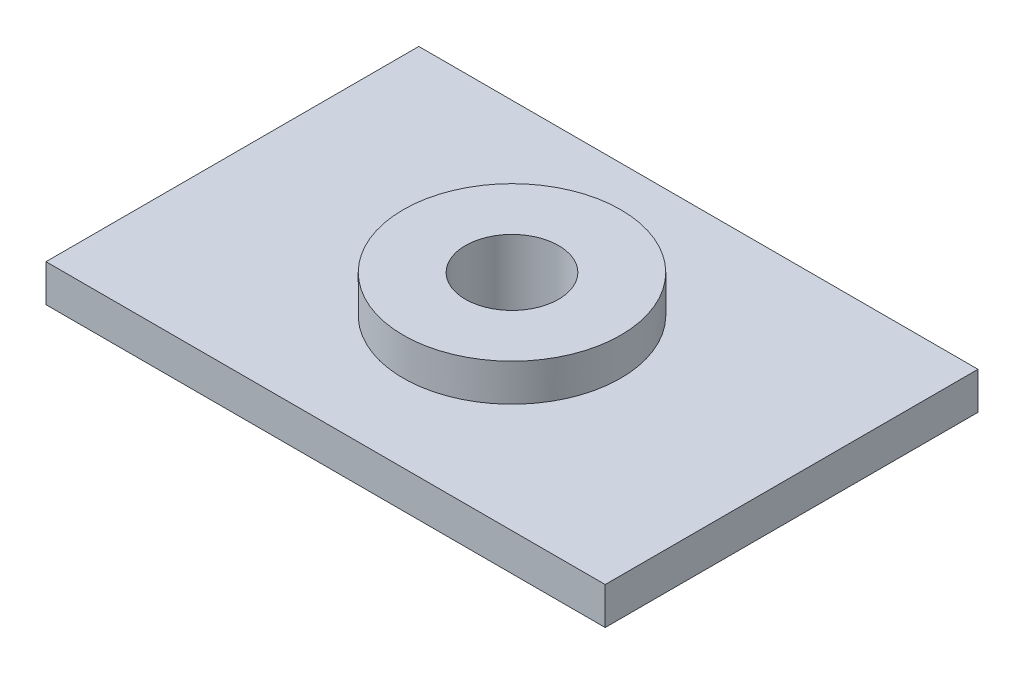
ISO-10303-21;
HEADER;
FILE_DESCRIPTION(('STEP AP214'),'2;1');
FILE_NAME('part.step','',(''),(''),'','','');
FILE_SCHEMA(('AUTOMOTIVE_DESIGN { 1 0 10303 214 1 1 1 1 }'));
ENDSEC;
DATA;
#1=APPLICATION_CONTEXT('core data for automotive mechanical design processes');
#2=APPLICATION_PROTOCOL_DEFINITION('international standard','automotive_design',2000,#1);
#3=PRODUCT_CONTEXT('',#1,'mechanical');
#4=PRODUCT('Part','Part','',(#3));
#5=PRODUCT_RELATED_PRODUCT_CATEGORY('part','',(#4));
#6=PRODUCT_DEFINITION_FORMATION('','',#4);
#7=PRODUCT_DEFINITION_CONTEXT('part definition',#1,'design');
#8=PRODUCT_DEFINITION('design','',#6,#7);
#9=PRODUCT_DEFINITION_SHAPE('','',#8);
#10=(LENGTH_UNIT() NAMED_UNIT(*) SI_UNIT(.MILLI.,.METRE.));
#11=(NAMED_UNIT(*) PLANE_ANGLE_UNIT() SI_UNIT($,.RADIAN.));
#12=(NAMED_UNIT(*) SI_UNIT($,.STERADIAN.) SOLID_ANGLE_UNIT());
#13=UNCERTAINTY_MEASURE_WITH_UNIT(LENGTH_MEASURE(1.E-05),#10,'distance_accuracy_value','');
#14=(GEOMETRIC_REPRESENTATION_CONTEXT(3) GLOBAL_UNCERTAINTY_ASSIGNED_CONTEXT((#13)) GLOBAL_UNIT_ASSIGNED_CONTEXT((#10,
#11,#12)) REPRESENTATION_CONTEXT('',''));
#15=CARTESIAN_POINT('',(0.,0.,0.));
#16=DIRECTION('',(0.,0.,1.));
#17=DIRECTION('',(1.,0.,0.));
#18=AXIS2_PLACEMENT_3D('',#15,#16,#17);
#19=CARTESIAN_POINT('',(0.,12.,-120.));
#20=DIRECTION('',(0.,-1.,0.));
#21=DIRECTION('',(0.,0.,-1.));
#22=AXIS2_PLACEMENT_3D('',#19,#20,#21);
#23=PLANE('',#22);
#24=DIRECTION('',(0.,0.,1.));
#25=VECTOR('',#24,1.);
#26=CARTESIAN_POINT('',(0.,12.,0.));
#27=LINE('',#26,#25);
#28=CARTESIAN_POINT('',(0.,12.,-120.));
#29=VERTEX_POINT('',#28);
#30=CARTESIAN_POINT('',(0.,12.,0.));
#31=VERTEX_POINT('',#30);
#32=EDGE_CURVE('E96',#29,#31,#27,.T.);
#33=ORIENTED_EDGE('',*,*,#32,.T.);
#34=DIRECTION('',(1.,0.,0.));
#35=VECTOR('',#34,1.);
#36=CARTESIAN_POINT('',(0.,12.,0.));
#37=LINE('',#36,#35);
#38=CARTESIAN_POINT('',(180.,12.,0.));
#39=VERTEX_POINT('',#38);
#40=EDGE_CURVE('E80',#31,#39,#37,.T.);
#41=ORIENTED_EDGE('',*,*,#40,.T.);
#42=DIRECTION('',(0.,0.,-1.));
#43=VECTOR('',#42,1.);
#44=CARTESIAN_POINT('',(180.,12.,0.));
#45=LINE('',#44,#43);
#46=CARTESIAN_POINT('',(180.,12.,-120.));
#47=VERTEX_POINT('',#46);
#48=EDGE_CURVE('E46',#39,#47,#45,.T.);
#49=ORIENTED_EDGE('',*,*,#48,.T.);
#50=DIRECTION('',(-1.,0.,0.));
#51=VECTOR('',#50,1.);
#52=CARTESIAN_POINT('',(0.,12.,-120.));
#53=LINE('',#52,#51);
#54=EDGE_CURVE('E41',#47,#29,#53,.T.);
#55=ORIENTED_EDGE('',*,*,#54,.T.);
#56=EDGE_LOOP('',(#33,#41,#49,#55));
#57=FACE_BOUND('',#56,.T.);
#58=CARTESIAN_POINT('',(90.,12.,-60.));
#59=DIRECTION('',(0.,-1.,0.));
#60=DIRECTION('',(0.,0.,-1.));
#61=AXIS2_PLACEMENT_3D('',#58,#59,#60);
#62=CIRCLE('',#61,35.);
#63=CARTESIAN_POINT('',(90.,12.,-95.));
#64=VERTEX_POINT('',#63);
#65=EDGE_CURVE('E11',#64,#64,#62,.F.);
#66=ORIENTED_EDGE('',*,*,#65,.F.);
#67=EDGE_LOOP('',(#66));
#68=FACE_BOUND('',#67,.T.);
#69=ADVANCED_FACE('F26',(#57,#68),#23,.F.);
#70=CARTESIAN_POINT('',(0.,12.,0.));
#71=DIRECTION('',(1.,0.,0.));
#72=DIRECTION('',(0.,0.,-1.));
#73=AXIS2_PLACEMENT_3D('',#70,#71,#72);
#74=PLANE('',#73);
#75=DIRECTION('',(0.,0.,1.));
#76=VECTOR('',#75,1.);
#77=CARTESIAN_POINT('',(0.,0.,0.));
#78=LINE('',#77,#76);
#79=CARTESIAN_POINT('',(0.,0.,-120.));
#80=VERTEX_POINT('',#79);
#81=CARTESIAN_POINT('',(0.,0.,0.));
#82=VERTEX_POINT('',#81);
#83=EDGE_CURVE('E72',#80,#82,#78,.T.);
#84=ORIENTED_EDGE('',*,*,#83,.T.);
#85=DIRECTION('',(0.,-1.,0.));
#86=VECTOR('',#85,1.);
#87=CARTESIAN_POINT('',(0.,12.,0.));
#88=LINE('',#87,#86);
#89=EDGE_CURVE('E34',#31,#82,#88,.T.);
#90=ORIENTED_EDGE('',*,*,#89,.F.);
#91=ORIENTED_EDGE('',*,*,#32,.F.);
#92=DIRECTION('',(0.,-1.,0.));
#93=VECTOR('',#92,1.);
#94=CARTESIAN_POINT('',(0.,12.,-120.));
#95=LINE('',#94,#93);
#96=EDGE_CURVE('E85',#29,#80,#95,.T.);
#97=ORIENTED_EDGE('',*,*,#96,.T.);
#98=EDGE_LOOP('',(#84,#90,#91,#97));
#99=FACE_BOUND('',#98,.T.);
#100=ADVANCED_FACE('F28',(#99),#74,.F.);
#101=CARTESIAN_POINT('',(0.,12.,0.));
#102=DIRECTION('',(0.,0.,-1.));
#103=DIRECTION('',(-1.,0.,0.));
#104=AXIS2_PLACEMENT_3D('',#101,#102,#103);
#105=PLANE('',#104);
#106=DIRECTION('',(1.,0.,0.));
#107=VECTOR('',#106,1.);
#108=CARTESIAN_POINT('',(0.,0.,0.));
#109=LINE('',#108,#107);
#110=CARTESIAN_POINT('',(180.,0.,0.));
#111=VERTEX_POINT('',#110);
#112=EDGE_CURVE('E67',#82,#111,#109,.T.);
#113=ORIENTED_EDGE('',*,*,#112,.T.);
#114=DIRECTION('',(0.,-1.,0.));
#115=VECTOR('',#114,1.);
#116=CARTESIAN_POINT('',(180.,12.,0.));
#117=LINE('',#116,#115);
#118=EDGE_CURVE('E83',#39,#111,#117,.T.);
#119=ORIENTED_EDGE('',*,*,#118,.F.);
#120=ORIENTED_EDGE('',*,*,#40,.F.);
#121=ORIENTED_EDGE('',*,*,#89,.T.);
#122=EDGE_LOOP('',(#113,#119,#120,#121));
#123=FACE_BOUND('',#122,.T.);
#124=ADVANCED_FACE('F79',(#123),#105,.F.);
#125=CARTESIAN_POINT('',(180.,12.,0.));
#126=DIRECTION('',(-1.,0.,0.));
#127=DIRECTION('',(0.,0.,1.));
#128=AXIS2_PLACEMENT_3D('',#125,#126,#127);
#129=PLANE('',#128);
#130=DIRECTION('',(0.,0.,-1.));
#131=VECTOR('',#130,1.);
#132=CARTESIAN_POINT('',(180.,0.,0.));
#133=LINE('',#132,#131);
#134=CARTESIAN_POINT('',(180.,0.,-120.));
#135=VERTEX_POINT('',#134);
#136=EDGE_CURVE('E73',#111,#135,#133,.T.);
#137=ORIENTED_EDGE('',*,*,#136,.T.);
#138=DIRECTION('',(0.,-1.,0.));
#139=VECTOR('',#138,1.);
#140=CARTESIAN_POINT('',(180.,12.,-120.));
#141=LINE('',#140,#139);
#142=EDGE_CURVE('E102',#47,#135,#141,.T.);
#143=ORIENTED_EDGE('',*,*,#142,.F.);
#144=ORIENTED_EDGE('',*,*,#48,.F.);
#145=ORIENTED_EDGE('',*,*,#118,.T.);
#146=EDGE_LOOP('',(#137,#143,#144,#145));
#147=FACE_BOUND('',#146,.T.);
#148=ADVANCED_FACE('F106',(#147),#129,.F.);
#149=CARTESIAN_POINT('',(0.,12.,-120.));
#150=DIRECTION('',(0.,0.,1.));
#151=DIRECTION('',(1.,0.,0.));
#152=AXIS2_PLACEMENT_3D('',#149,#150,#151);
#153=PLANE('',#152);
#154=DIRECTION('',(-1.,0.,0.));
#155=VECTOR('',#154,1.);
#156=CARTESIAN_POINT('',(0.,0.,-120.));
#157=LINE('',#156,#155);
#158=EDGE_CURVE('E94',#135,#80,#157,.T.);
#159=ORIENTED_EDGE('',*,*,#158,.T.);
#160=ORIENTED_EDGE('',*,*,#96,.F.);
#161=ORIENTED_EDGE('',*,*,#54,.F.);
#162=ORIENTED_EDGE('',*,*,#142,.T.);
#163=EDGE_LOOP('',(#159,#160,#161,#162));
#164=FACE_BOUND('',#163,.T.);
#165=ADVANCED_FACE('F108',(#164),#153,.F.);
#166=CARTESIAN_POINT('',(0.,0.,-120.));
#167=DIRECTION('',(0.,-1.,0.));
#168=DIRECTION('',(0.,0.,-1.));
#169=AXIS2_PLACEMENT_3D('',#166,#167,#168);
#170=PLANE('',#169);
#171=CARTESIAN_POINT('',(90.,0.,-60.));
#172=DIRECTION('',(0.,1.,0.));
#173=DIRECTION('',(0.,0.,1.));
#174=AXIS2_PLACEMENT_3D('',#171,#172,#173);
#175=CIRCLE('',#174,15.);
#176=CARTESIAN_POINT('',(90.,0.,-45.));
#177=VERTEX_POINT('',#176);
#178=EDGE_CURVE('E89',#177,#177,#175,.T.);
#179=ORIENTED_EDGE('',*,*,#178,.T.);
#180=EDGE_LOOP('',(#179));
#181=FACE_BOUND('',#180,.T.);
#182=ORIENTED_EDGE('',*,*,#83,.F.);
#183=ORIENTED_EDGE('',*,*,#158,.F.);
#184=ORIENTED_EDGE('',*,*,#136,.F.);
#185=ORIENTED_EDGE('',*,*,#112,.F.);
#186=EDGE_LOOP('',(#182,#183,#184,#185));
#187=FACE_BOUND('',#186,.T.);
#188=ADVANCED_FACE('F69',(#181,#187),#170,.T.);
#189=CARTESIAN_POINT('',(90.,24.,-60.));
#190=DIRECTION('',(0.,-1.,0.));
#191=DIRECTION('',(0.,0.,-1.));
#192=AXIS2_PLACEMENT_3D('',#189,#190,#191);
#193=CYLINDRICAL_SURFACE('',#192,35.);
#194=CARTESIAN_POINT('',(90.,24.,-60.));
#195=DIRECTION('',(0.,1.,0.));
#196=DIRECTION('',(0.,0.,1.));
#197=AXIS2_PLACEMENT_3D('',#194,#195,#196);
#198=CIRCLE('',#197,35.);
#199=CARTESIAN_POINT('',(90.,24.,-25.));
#200=VERTEX_POINT('',#199);
#201=EDGE_CURVE('E86',#200,#200,#198,.T.);
#202=ORIENTED_EDGE('',*,*,#201,.F.);
#203=EDGE_LOOP('',(#202));
#204=FACE_BOUND('',#203,.T.);
#205=ORIENTED_EDGE('',*,*,#65,.T.);
#206=EDGE_LOOP('',(#205));
#207=FACE_BOUND('',#206,.T.);
#208=ADVANCED_FACE('F114',(#204,#207),#193,.T.);
#209=CARTESIAN_POINT('',(90.,24.,-60.));
#210=DIRECTION('',(0.,1.,0.));
#211=DIRECTION('',(0.,0.,1.));
#212=AXIS2_PLACEMENT_3D('',#209,#210,#211);
#213=PLANE('',#212);
#214=CARTESIAN_POINT('',(90.,24.,-60.));
#215=DIRECTION('',(0.,1.,0.));
#216=DIRECTION('',(0.,0.,1.));
#217=AXIS2_PLACEMENT_3D('',#214,#215,#216);
#218=CIRCLE('',#217,15.);
#219=CARTESIAN_POINT('',(90.,24.,-45.));
#220=VERTEX_POINT('',#219);
#221=EDGE_CURVE('E177',#220,#220,#218,.T.);
#222=ORIENTED_EDGE('',*,*,#221,.F.);
#223=EDGE_LOOP('',(#222));
#224=FACE_BOUND('',#223,.T.);
#225=ORIENTED_EDGE('',*,*,#201,.T.);
#226=EDGE_LOOP('',(#225));
#227=FACE_BOUND('',#226,.T.);
#228=ADVANCED_FACE('F116',(#224,#227),#213,.T.);
#229=CARTESIAN_POINT('',(90.,0.,-60.));
#230=DIRECTION('',(0.,1.,0.));
#231=DIRECTION('',(0.,0.,1.));
#232=AXIS2_PLACEMENT_3D('',#229,#230,#231);
#233=CYLINDRICAL_SURFACE('',#232,15.);
#234=ORIENTED_EDGE('',*,*,#178,.F.);
#235=EDGE_LOOP('',(#234));
#236=FACE_BOUND('',#235,.T.);
#237=ORIENTED_EDGE('',*,*,#221,.T.);
#238=EDGE_LOOP('',(#237));
#239=FACE_BOUND('',#238,.T.);
#240=ADVANCED_FACE('F123',(#236,#239),#233,.F.);
#241=CLOSED_SHELL('',(#69,#100,#124,#148,#165,#188,#208,#228,#240));
#242=MANIFOLD_SOLID_BREP('B2',#241);
#243=ADVANCED_BREP_SHAPE_REPRESENTATION('',(#18,#242),#14);
#244=SHAPE_DEFINITION_REPRESENTATION(#9,#243);
ENDSEC;
END-ISO-10303-21;
